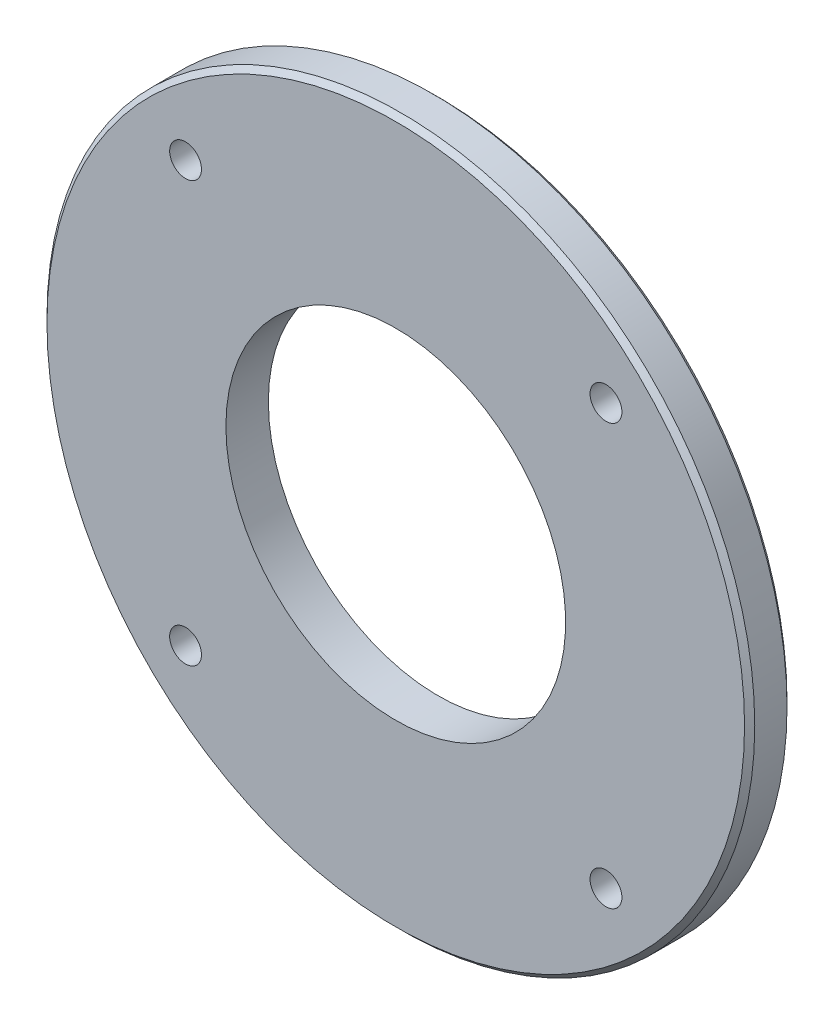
ISO-10303-21;
HEADER;
FILE_DESCRIPTION(('STEP AP214'),'2;1');
FILE_NAME('part.step','',(''),(''),'','','');
FILE_SCHEMA(('AUTOMOTIVE_DESIGN { 1 0 10303 214 1 1 1 1 }'));
ENDSEC;
DATA;
#1=APPLICATION_CONTEXT('core data for automotive mechanical design processes');
#2=APPLICATION_PROTOCOL_DEFINITION('international standard','automotive_design',2000,#1);
#3=PRODUCT_CONTEXT('',#1,'mechanical');
#4=PRODUCT('Part','Part','',(#3));
#5=PRODUCT_RELATED_PRODUCT_CATEGORY('part','',(#4));
#6=PRODUCT_DEFINITION_FORMATION('','',#4);
#7=PRODUCT_DEFINITION_CONTEXT('part definition',#1,'design');
#8=PRODUCT_DEFINITION('design','',#6,#7);
#9=PRODUCT_DEFINITION_SHAPE('','',#8);
#10=(LENGTH_UNIT() NAMED_UNIT(*) SI_UNIT(.MILLI.,.METRE.));
#11=(NAMED_UNIT(*) PLANE_ANGLE_UNIT() SI_UNIT($,.RADIAN.));
#12=(NAMED_UNIT(*) SI_UNIT($,.STERADIAN.) SOLID_ANGLE_UNIT());
#13=UNCERTAINTY_MEASURE_WITH_UNIT(LENGTH_MEASURE(1.E-05),#10,'distance_accuracy_value','');
#14=(GEOMETRIC_REPRESENTATION_CONTEXT(3) GLOBAL_UNCERTAINTY_ASSIGNED_CONTEXT((#13)) GLOBAL_UNIT_ASSIGNED_CONTEXT((#10,
#11,#12)) REPRESENTATION_CONTEXT('',''));
#15=CARTESIAN_POINT('',(0.,0.,0.));
#16=DIRECTION('',(0.,0.,1.));
#17=DIRECTION('',(1.,0.,0.));
#18=AXIS2_PLACEMENT_3D('',#15,#16,#17);
#19=CARTESIAN_POINT('',(0.,0.,9.52500000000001));
#20=DIRECTION('',(0.,0.,1.));
#21=DIRECTION('',(1.,0.,0.));
#22=AXIS2_PLACEMENT_3D('',#19,#20,#21);
#23=PLANE('',#22);
#24=CARTESIAN_POINT('',(0.,0.,9.52500000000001));
#25=DIRECTION('',(0.,0.,1.));
#26=DIRECTION('',(1.,0.,0.));
#27=AXIS2_PLACEMENT_3D('',#24,#25,#26);
#28=CIRCLE('',#27,78.232);
#29=CARTESIAN_POINT('',(78.2320000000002,0.,9.52500000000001));
#30=VERTEX_POINT('',#29);
#31=EDGE_CURVE('E10',#30,#30,#28,.T.);
#32=ORIENTED_EDGE('',*,*,#31,.T.);
#33=EDGE_LOOP('',(#32));
#34=FACE_BOUND('',#33,.T.);
#35=CARTESIAN_POINT('',(-47.1463446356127,47.1463446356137,9.52500000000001));
#36=DIRECTION('',(0.,0.,1.));
#37=DIRECTION('',(0.,1.,0.));
#38=AXIS2_PLACEMENT_3D('',#35,#36,#37);
#39=CIRCLE('',#38,3.5687);
#40=CARTESIAN_POINT('',(-43.5776446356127,47.1463446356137,9.525));
#41=VERTEX_POINT('',#40);
#42=EDGE_CURVE('E426',#41,#41,#39,.T.);
#43=ORIENTED_EDGE('',*,*,#42,.F.);
#44=EDGE_LOOP('',(#43));
#45=FACE_BOUND('',#44,.T.);
#46=CARTESIAN_POINT('',(-47.1463446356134,-47.1463446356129,9.52500000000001));
#47=DIRECTION('',(0.,0.,1.));
#48=DIRECTION('',(-1.,0.,0.));
#49=AXIS2_PLACEMENT_3D('',#46,#47,#48);
#50=CIRCLE('',#49,3.5687);
#51=CARTESIAN_POINT('',(-43.5776446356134,-47.1463446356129,9.525));
#52=VERTEX_POINT('',#51);
#53=EDGE_CURVE('E420',#52,#52,#50,.T.);
#54=ORIENTED_EDGE('',*,*,#53,.F.);
#55=EDGE_LOOP('',(#54));
#56=FACE_BOUND('',#55,.T.);
#57=CARTESIAN_POINT('',(47.1463446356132,-47.1463446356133,9.52500000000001));
#58=DIRECTION('',(0.,0.,1.));
#59=DIRECTION('',(0.,-1.,0.));
#60=AXIS2_PLACEMENT_3D('',#57,#58,#59);
#61=CIRCLE('',#60,3.5687);
#62=CARTESIAN_POINT('',(50.7150446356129,-47.1463446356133,9.525));
#63=VERTEX_POINT('',#62);
#64=EDGE_CURVE('E414',#63,#63,#61,.T.);
#65=ORIENTED_EDGE('',*,*,#64,.F.);
#66=EDGE_LOOP('',(#65));
#67=FACE_BOUND('',#66,.T.);
#68=CARTESIAN_POINT('',(47.1463446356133,47.1463446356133,9.52500000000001));
#69=DIRECTION('',(0.,0.,1.));
#70=DIRECTION('',(1.,0.,0.));
#71=AXIS2_PLACEMENT_3D('',#68,#69,#70);
#72=CIRCLE('',#71,3.5687);
#73=CARTESIAN_POINT('',(50.7150446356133,47.1463446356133,9.525));
#74=VERTEX_POINT('',#73);
#75=EDGE_CURVE('E408',#74,#74,#72,.T.);
#76=ORIENTED_EDGE('',*,*,#75,.F.);
#77=EDGE_LOOP('',(#76));
#78=FACE_BOUND('',#77,.T.);
#79=CARTESIAN_POINT('',(0.,0.,9.52500000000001));
#80=DIRECTION('',(0.,0.,1.));
#81=DIRECTION('',(1.,0.,0.));
#82=AXIS2_PLACEMENT_3D('',#79,#80,#81);
#83=CIRCLE('',#82,38.1);
#84=CARTESIAN_POINT('',(-38.1000000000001,0.,9.52500000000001));
#85=VERTEX_POINT('',#84);
#86=EDGE_CURVE('E399',#85,#85,#83,.T.);
#87=ORIENTED_EDGE('',*,*,#86,.F.);
#88=EDGE_LOOP('',(#87));
#89=FACE_BOUND('',#88,.T.);
#90=ADVANCED_FACE('F379',(#34,#45,#56,#67,#78,#89),#23,.T.);
#91=CARTESIAN_POINT('',(0.,0.,0.));
#92=DIRECTION('',(0.,0.,1.));
#93=DIRECTION('',(1.,0.,0.));
#94=AXIS2_PLACEMENT_3D('',#91,#92,#93);
#95=PLANE('',#94);
#96=CARTESIAN_POINT('',(0.,0.,0.));
#97=DIRECTION('',(0.,0.,1.));
#98=DIRECTION('',(1.,0.,0.));
#99=AXIS2_PLACEMENT_3D('',#96,#97,#98);
#100=CIRCLE('',#99,78.232);
#101=CARTESIAN_POINT('',(78.2320000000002,0.,0.));
#102=VERTEX_POINT('',#101);
#103=EDGE_CURVE('E386',#102,#102,#100,.F.);
#104=ORIENTED_EDGE('',*,*,#103,.T.);
#105=EDGE_LOOP('',(#104));
#106=FACE_BOUND('',#105,.T.);
#107=CARTESIAN_POINT('',(-47.1463446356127,47.1463446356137,0.));
#108=DIRECTION('',(0.,0.,1.));
#109=DIRECTION('',(0.,1.,0.));
#110=AXIS2_PLACEMENT_3D('',#107,#108,#109);
#111=CIRCLE('',#110,3.5687);
#112=CARTESIAN_POINT('',(-43.5776446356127,47.1463446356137,0.));
#113=VERTEX_POINT('',#112);
#114=EDGE_CURVE('E423',#113,#113,#111,.T.);
#115=ORIENTED_EDGE('',*,*,#114,.T.);
#116=EDGE_LOOP('',(#115));
#117=FACE_BOUND('',#116,.T.);
#118=CARTESIAN_POINT('',(-47.1463446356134,-47.1463446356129,0.));
#119=DIRECTION('',(0.,0.,1.));
#120=DIRECTION('',(-1.,0.,0.));
#121=AXIS2_PLACEMENT_3D('',#118,#119,#120);
#122=CIRCLE('',#121,3.5687);
#123=CARTESIAN_POINT('',(-43.5776446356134,-47.1463446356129,0.));
#124=VERTEX_POINT('',#123);
#125=EDGE_CURVE('E417',#124,#124,#122,.T.);
#126=ORIENTED_EDGE('',*,*,#125,.T.);
#127=EDGE_LOOP('',(#126));
#128=FACE_BOUND('',#127,.T.);
#129=CARTESIAN_POINT('',(47.1463446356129,-47.1463446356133,0.));
#130=DIRECTION('',(0.,0.,1.));
#131=DIRECTION('',(0.,-1.,0.));
#132=AXIS2_PLACEMENT_3D('',#129,#130,#131);
#133=CIRCLE('',#132,3.5687);
#134=CARTESIAN_POINT('',(50.7150446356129,-47.1463446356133,0.));
#135=VERTEX_POINT('',#134);
#136=EDGE_CURVE('E411',#135,#135,#133,.T.);
#137=ORIENTED_EDGE('',*,*,#136,.T.);
#138=EDGE_LOOP('',(#137));
#139=FACE_BOUND('',#138,.T.);
#140=CARTESIAN_POINT('',(47.1463446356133,47.1463446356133,0.));
#141=DIRECTION('',(0.,0.,1.));
#142=DIRECTION('',(1.,0.,0.));
#143=AXIS2_PLACEMENT_3D('',#140,#141,#142);
#144=CIRCLE('',#143,3.5687);
#145=CARTESIAN_POINT('',(50.7150446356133,47.1463446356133,0.));
#146=VERTEX_POINT('',#145);
#147=EDGE_CURVE('E405',#146,#146,#144,.T.);
#148=ORIENTED_EDGE('',*,*,#147,.T.);
#149=EDGE_LOOP('',(#148));
#150=FACE_BOUND('',#149,.T.);
#151=CARTESIAN_POINT('',(0.,0.,0.));
#152=DIRECTION('',(0.,0.,1.));
#153=DIRECTION('',(1.,0.,0.));
#154=AXIS2_PLACEMENT_3D('',#151,#152,#153);
#155=CIRCLE('',#154,38.1);
#156=CARTESIAN_POINT('',(-38.1000000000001,0.,0.));
#157=VERTEX_POINT('',#156);
#158=EDGE_CURVE('E402',#157,#157,#155,.T.);
#159=ORIENTED_EDGE('',*,*,#158,.T.);
#160=EDGE_LOOP('',(#159));
#161=FACE_BOUND('',#160,.T.);
#162=ADVANCED_FACE('F434',(#106,#117,#128,#139,#150,#161),#95,.F.);
#163=CARTESIAN_POINT('',(0.,0.,9.52500000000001));
#164=DIRECTION('',(0.,0.,-1.));
#165=DIRECTION('',(-1.,0.,0.));
#166=AXIS2_PLACEMENT_3D('',#163,#164,#165);
#167=CYLINDRICAL_SURFACE('',#166,79.375);
#168=CARTESIAN_POINT('',(0.,0.,1.14299999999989));
#169=DIRECTION('',(0.,0.,1.));
#170=DIRECTION('',(1.,0.,0.));
#171=AXIS2_PLACEMENT_3D('',#168,#169,#170);
#172=CIRCLE('',#171,79.375);
#173=CARTESIAN_POINT('',(-79.3750000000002,0.,1.1429999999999));
#174=VERTEX_POINT('',#173);
#175=EDGE_CURVE('E390',#174,#174,#172,.T.);
#176=CARTESIAN_POINT('',(0.,0.,8.38200000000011));
#177=DIRECTION('',(0.,0.,1.));
#178=DIRECTION('',(1.,0.,0.));
#179=AXIS2_PLACEMENT_3D('',#176,#177,#178);
#180=CIRCLE('',#179,79.375);
#181=CARTESIAN_POINT('',(-79.3750000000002,0.,8.38200000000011));
#182=VERTEX_POINT('',#181);
#183=EDGE_CURVE('E394',#182,#182,#180,.F.);
#184=CARTESIAN_POINT('',(-79.3750000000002,0.,1.1429999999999));
#185=CARTESIAN_POINT('',(-79.3750000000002,0.,1.2184062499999));
#186=CARTESIAN_POINT('',(-79.3750000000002,0.,1.2938124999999));
#187=CARTESIAN_POINT('',(-79.3750000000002,0.,1.44462499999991));
#188=CARTESIAN_POINT('',(-79.3750000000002,0.,1.52003124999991));
#189=CARTESIAN_POINT('',(-79.3750000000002,0.,1.67084374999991));
#190=CARTESIAN_POINT('',(-79.3750000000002,0.,1.74624999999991));
#191=CARTESIAN_POINT('',(-79.3750000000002,0.,1.89706249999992));
#192=CARTESIAN_POINT('',(-79.3750000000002,0.,1.97246874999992));
#193=CARTESIAN_POINT('',(-79.3750000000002,0.,2.12328124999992));
#194=CARTESIAN_POINT('',(-79.3750000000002,0.,2.19868749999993));
#195=CARTESIAN_POINT('',(-79.3750000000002,0.,2.34949999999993));
#196=CARTESIAN_POINT('',(-79.3750000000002,0.,2.42490624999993));
#197=CARTESIAN_POINT('',(-79.3750000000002,0.,2.57571874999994));
#198=CARTESIAN_POINT('',(-79.3750000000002,0.,2.65112499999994));
#199=CARTESIAN_POINT('',(-79.3750000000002,0.,2.80193749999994));
#200=CARTESIAN_POINT('',(-79.3750000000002,0.,2.87734374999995));
#201=CARTESIAN_POINT('',(-79.3750000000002,0.,3.02815624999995));
#202=CARTESIAN_POINT('',(-79.3750000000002,0.,3.10356249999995));
#203=CARTESIAN_POINT('',(-79.3750000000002,0.,3.25437499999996));
#204=CARTESIAN_POINT('',(-79.3750000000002,0.,3.32978124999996));
#205=CARTESIAN_POINT('',(-79.3750000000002,0.,3.48059374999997));
#206=CARTESIAN_POINT('',(-79.3750000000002,0.,3.55599999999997));
#207=CARTESIAN_POINT('',(-79.3750000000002,0.,3.70681249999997));
#208=CARTESIAN_POINT('',(-79.3750000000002,0.,3.78221874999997));
#209=CARTESIAN_POINT('',(-79.3750000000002,0.,3.93303124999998));
#210=CARTESIAN_POINT('',(-79.3750000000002,0.,4.00843749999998));
#211=CARTESIAN_POINT('',(-79.3750000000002,0.,4.15924999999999));
#212=CARTESIAN_POINT('',(-79.3750000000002,0.,4.23465624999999));
#213=CARTESIAN_POINT('',(-79.3750000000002,0.,4.38546874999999));
#214=CARTESIAN_POINT('',(-79.3750000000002,0.,4.46087499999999));
#215=CARTESIAN_POINT('',(-79.3750000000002,0.,4.6116875));
#216=CARTESIAN_POINT('',(-79.3750000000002,0.,4.68709375));
#217=CARTESIAN_POINT('',(-79.3750000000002,0.,4.83790625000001));
#218=CARTESIAN_POINT('',(-79.3750000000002,0.,4.91331250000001));
#219=CARTESIAN_POINT('',(-79.3750000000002,0.,5.06412500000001));
#220=CARTESIAN_POINT('',(-79.3750000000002,0.,5.13953125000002));
#221=CARTESIAN_POINT('',(-79.3750000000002,0.,5.29034375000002));
#222=CARTESIAN_POINT('',(-79.3750000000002,0.,5.36575000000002));
#223=CARTESIAN_POINT('',(-79.3750000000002,0.,5.51656250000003));
#224=CARTESIAN_POINT('',(-79.3750000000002,0.,5.59196875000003));
#225=CARTESIAN_POINT('',(-79.3750000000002,0.,5.74278125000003));
#226=CARTESIAN_POINT('',(-79.3750000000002,0.,5.81818750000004));
#227=CARTESIAN_POINT('',(-79.3750000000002,0.,5.96900000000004));
#228=CARTESIAN_POINT('',(-79.3750000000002,0.,6.04440625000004));
#229=CARTESIAN_POINT('',(-79.3750000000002,0.,6.19521875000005));
#230=CARTESIAN_POINT('',(-79.3750000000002,0.,6.27062500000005));
#231=CARTESIAN_POINT('',(-79.3750000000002,0.,6.42143750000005));
#232=CARTESIAN_POINT('',(-79.3750000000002,0.,6.49684375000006));
#233=CARTESIAN_POINT('',(-79.3750000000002,0.,6.64765625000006));
#234=CARTESIAN_POINT('',(-79.3750000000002,0.,6.72306250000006));
#235=CARTESIAN_POINT('',(-79.3750000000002,0.,6.87387500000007));
#236=CARTESIAN_POINT('',(-79.3750000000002,0.,6.94928125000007));
#237=CARTESIAN_POINT('',(-79.3750000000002,0.,7.10009375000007));
#238=CARTESIAN_POINT('',(-79.3750000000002,0.,7.17550000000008));
#239=CARTESIAN_POINT('',(-79.3750000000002,0.,7.32631250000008));
#240=CARTESIAN_POINT('',(-79.3750000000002,0.,7.40171875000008));
#241=CARTESIAN_POINT('',(-79.3750000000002,0.,7.55253125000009));
#242=CARTESIAN_POINT('',(-79.3750000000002,0.,7.62793750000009));
#243=CARTESIAN_POINT('',(-79.3750000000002,0.,7.77875000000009));
#244=CARTESIAN_POINT('',(-79.3750000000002,0.,7.8541562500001));
#245=CARTESIAN_POINT('',(-79.3750000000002,0.,8.0049687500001));
#246=CARTESIAN_POINT('',(-79.3750000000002,0.,8.0803750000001));
#247=CARTESIAN_POINT('',(-79.3750000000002,0.,8.23118750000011));
#248=CARTESIAN_POINT('',(-79.3750000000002,0.,8.30659375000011));
#249=CARTESIAN_POINT('',(-79.3750000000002,0.,8.38200000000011));
#250=B_SPLINE_CURVE_WITH_KNOTS('',3,(#184,#185,#186,#187,#188,#189,#190,#191,#192,#193,#194,
#195,#196,#197,#198,#199,#200,#201,#202,#203,#204,#205,#206,#207,#208,#209,#210,#211,#212,#213,
#214,#215,#216,#217,#218,#219,#220,#221,#222,#223,#224,#225,#226,#227,#228,#229,#230,#231,#232,
#233,#234,#235,#236,#237,#238,#239,#240,#241,#242,#243,#244,#245,#246,#247,#248,#249),
.UNSPECIFIED.,.F.,.F.,(4,2,2,2,2,2,2,2,2,2,2,2,2,2,2,2,2,2,2,2,2,2,2,2,2,2,2,2,2,2,2,2,4),(0.,
0.226218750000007,0.452437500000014,0.67865625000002,0.904875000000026,1.13109375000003,
1.35731250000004,1.58353125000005,1.80975000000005,2.03596875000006,2.26218750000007,
2.48840625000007,2.71462500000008,2.94084375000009,3.16706250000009,3.3932812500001,
3.61950000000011,3.84571875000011,4.07193750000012,4.29815625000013,4.52437500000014,
4.75059375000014,4.97681250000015,5.20303125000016,5.42925000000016,5.65546875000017,
5.88168750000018,6.10790625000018,6.33412500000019,6.5603437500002,6.7865625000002,
7.01278125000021,7.23900000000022),.UNSPECIFIED.);
#251=EDGE_CURVE('BSEAM381',#174,#182,#250,.T.);
#252=ORIENTED_EDGE('',*,*,#175,.T.);
#253=ORIENTED_EDGE('',*,*,#183,.T.);
#254=ORIENTED_EDGE('',*,*,#251,.T.);
#255=ORIENTED_EDGE('',*,*,#251,.F.);
#256=EDGE_LOOP('',(#252,#254,#253,#255));
#257=FACE_BOUND('',#256,.T.);
#258=ADVANCED_FACE('F381',(#257),#167,.T.);
#259=CARTESIAN_POINT('',(0.,0.,9.52500000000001));
#260=DIRECTION('',(0.,0.,-1.));
#261=DIRECTION('',(-1.,0.,0.));
#262=AXIS2_PLACEMENT_3D('',#259,#260,#261);
#263=CYLINDRICAL_SURFACE('',#262,38.1);
#264=CARTESIAN_POINT('',(-38.1000000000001,0.,9.52500000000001));
#265=CARTESIAN_POINT('',(-38.1000000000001,0.,9.42578125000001));
#266=CARTESIAN_POINT('',(-38.1000000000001,0.,9.32656250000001));
#267=CARTESIAN_POINT('',(-38.1000000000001,0.,9.12812500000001));
#268=CARTESIAN_POINT('',(-38.1000000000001,0.,9.02890625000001));
#269=CARTESIAN_POINT('',(-38.1000000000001,0.,8.83046875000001));
#270=CARTESIAN_POINT('',(-38.1000000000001,0.,8.73125000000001));
#271=CARTESIAN_POINT('',(-38.1000000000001,0.,8.53281250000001));
#272=CARTESIAN_POINT('',(-38.1000000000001,0.,8.43359375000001));
#273=CARTESIAN_POINT('',(-38.1000000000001,0.,8.23515625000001));
#274=CARTESIAN_POINT('',(-38.1000000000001,0.,8.13593750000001));
#275=CARTESIAN_POINT('',(-38.1000000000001,0.,7.93750000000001));
#276=CARTESIAN_POINT('',(-38.1000000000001,0.,7.83828125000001));
#277=CARTESIAN_POINT('',(-38.1000000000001,0.,7.63984375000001));
#278=CARTESIAN_POINT('',(-38.1000000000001,0.,7.54062500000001));
#279=CARTESIAN_POINT('',(-38.1000000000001,0.,7.34218750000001));
#280=CARTESIAN_POINT('',(-38.1000000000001,0.,7.24296875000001));
#281=CARTESIAN_POINT('',(-38.1000000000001,0.,7.04453125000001));
#282=CARTESIAN_POINT('',(-38.1000000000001,0.,6.94531250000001));
#283=CARTESIAN_POINT('',(-38.1000000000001,0.,6.74687500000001));
#284=CARTESIAN_POINT('',(-38.1000000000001,0.,6.64765625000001));
#285=CARTESIAN_POINT('',(-38.1000000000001,0.,6.44921875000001));
#286=CARTESIAN_POINT('',(-38.1000000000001,0.,6.35000000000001));
#287=CARTESIAN_POINT('',(-38.1000000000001,0.,6.15156250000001));
#288=CARTESIAN_POINT('',(-38.1000000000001,0.,6.05234375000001));
#289=CARTESIAN_POINT('',(-38.1000000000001,0.,5.85390625));
#290=CARTESIAN_POINT('',(-38.1000000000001,0.,5.75468750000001));
#291=CARTESIAN_POINT('',(-38.1000000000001,0.,5.55625));
#292=CARTESIAN_POINT('',(-38.1000000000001,0.,5.45703125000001));
#293=CARTESIAN_POINT('',(-38.1000000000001,0.,5.25859375));
#294=CARTESIAN_POINT('',(-38.1000000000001,0.,5.15937500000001));
#295=CARTESIAN_POINT('',(-38.1000000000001,0.,4.9609375));
#296=CARTESIAN_POINT('',(-38.1000000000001,0.,4.86171875));
#297=CARTESIAN_POINT('',(-38.1000000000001,0.,4.66328125));
#298=CARTESIAN_POINT('',(-38.1000000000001,0.,4.5640625));
#299=CARTESIAN_POINT('',(-38.1000000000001,0.,4.365625));
#300=CARTESIAN_POINT('',(-38.1000000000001,0.,4.26640625));
#301=CARTESIAN_POINT('',(-38.1000000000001,0.,4.06796875));
#302=CARTESIAN_POINT('',(-38.1000000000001,0.,3.96875));
#303=CARTESIAN_POINT('',(-38.1000000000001,0.,3.7703125));
#304=CARTESIAN_POINT('',(-38.1000000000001,0.,3.67109375));
#305=CARTESIAN_POINT('',(-38.1000000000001,0.,3.47265625));
#306=CARTESIAN_POINT('',(-38.1000000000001,0.,3.3734375));
#307=CARTESIAN_POINT('',(-38.1000000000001,0.,3.175));
#308=CARTESIAN_POINT('',(-38.1000000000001,0.,3.07578125));
#309=CARTESIAN_POINT('',(-38.1000000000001,0.,2.87734375));
#310=CARTESIAN_POINT('',(-38.1000000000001,0.,2.778125));
#311=CARTESIAN_POINT('',(-38.1000000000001,0.,2.5796875));
#312=CARTESIAN_POINT('',(-38.1000000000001,0.,2.48046875));
#313=CARTESIAN_POINT('',(-38.1000000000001,0.,2.28203125));
#314=CARTESIAN_POINT('',(-38.1000000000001,0.,2.1828125));
#315=CARTESIAN_POINT('',(-38.1000000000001,0.,1.984375));
#316=CARTESIAN_POINT('',(-38.1000000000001,0.,1.88515625));
#317=CARTESIAN_POINT('',(-38.1000000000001,0.,1.68671875));
#318=CARTESIAN_POINT('',(-38.1000000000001,0.,1.5875));
#319=CARTESIAN_POINT('',(-38.1000000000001,0.,1.3890625));
#320=CARTESIAN_POINT('',(-38.1000000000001,0.,1.28984375));
#321=CARTESIAN_POINT('',(-38.1000000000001,0.,1.09140625));
#322=CARTESIAN_POINT('',(-38.1000000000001,0.,0.992187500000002));
#323=CARTESIAN_POINT('',(-38.1000000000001,0.,0.793750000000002));
#324=CARTESIAN_POINT('',(-38.1000000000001,0.,0.694531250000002));
#325=CARTESIAN_POINT('',(-38.1000000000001,0.,0.496093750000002));
#326=CARTESIAN_POINT('',(-38.1000000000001,0.,0.396875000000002));
#327=CARTESIAN_POINT('',(-38.1000000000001,0.,0.198437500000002));
#328=CARTESIAN_POINT('',(-38.1000000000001,0.,0.0992187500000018));
#329=CARTESIAN_POINT('',(-38.1000000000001,0.,0.));
#330=B_SPLINE_CURVE_WITH_KNOTS('',3,(#264,#265,#266,#267,#268,#269,#270,#271,#272,#273,#274,
#275,#276,#277,#278,#279,#280,#281,#282,#283,#284,#285,#286,#287,#288,#289,#290,#291,#292,#293,
#294,#295,#296,#297,#298,#299,#300,#301,#302,#303,#304,#305,#306,#307,#308,#309,#310,#311,#312,
#313,#314,#315,#316,#317,#318,#319,#320,#321,#322,#323,#324,#325,#326,#327,#328,#329),
.UNSPECIFIED.,.F.,.F.,(4,2,2,2,2,2,2,2,2,2,2,2,2,2,2,2,2,2,2,2,2,2,2,2,2,2,2,2,2,2,2,2,4),(0.,
0.297656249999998,0.595312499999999,0.892968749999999,1.190625,1.48828125,1.7859375,2.08359375,
2.38125,2.67890625,2.9765625,3.27421875,3.571875,3.86953125,4.1671875,4.46484375,4.7625,
5.06015625,5.3578125,5.65546875,5.953125,6.25078125,6.5484375,6.84609375,7.14375,7.44140625,
7.7390625,8.03671875,8.334375,8.63203125,8.9296875,9.22734375,9.525),.UNSPECIFIED.);
#331=EDGE_CURVE('BSEAM443',#85,#157,#330,.T.);
#332=ORIENTED_EDGE('',*,*,#86,.T.);
#333=ORIENTED_EDGE('',*,*,#158,.F.);
#334=ORIENTED_EDGE('',*,*,#331,.T.);
#335=ORIENTED_EDGE('',*,*,#331,.F.);
#336=EDGE_LOOP('',(#332,#334,#333,#335));
#337=FACE_BOUND('',#336,.T.);
#338=ADVANCED_FACE('F443',(#337),#263,.F.);
#339=CARTESIAN_POINT('',(47.1463446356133,47.1463446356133,0.));
#340=DIRECTION('',(0.,0.,1.));
#341=DIRECTION('',(1.,0.,0.));
#342=AXIS2_PLACEMENT_3D('',#339,#340,#341);
#343=CYLINDRICAL_SURFACE('',#342,3.5687);
#344=CARTESIAN_POINT('',(50.7150446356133,47.1463446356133,0.));
#345=CARTESIAN_POINT('',(50.7150446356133,47.1463446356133,0.0992187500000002));
#346=CARTESIAN_POINT('',(50.7150446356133,47.1463446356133,0.1984375));
#347=CARTESIAN_POINT('',(50.7150446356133,47.1463446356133,0.396875));
#348=CARTESIAN_POINT('',(50.7150446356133,47.1463446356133,0.49609375));
#349=CARTESIAN_POINT('',(50.7150446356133,47.1463446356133,0.69453125));
#350=CARTESIAN_POINT('',(50.7150446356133,47.1463446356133,0.79375));
#351=CARTESIAN_POINT('',(50.7150446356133,47.1463446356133,0.9921875));
#352=CARTESIAN_POINT('',(50.7150446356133,47.1463446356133,1.09140625));
#353=CARTESIAN_POINT('',(50.7150446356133,47.1463446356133,1.28984375));
#354=CARTESIAN_POINT('',(50.7150446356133,47.1463446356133,1.3890625));
#355=CARTESIAN_POINT('',(50.7150446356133,47.1463446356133,1.5875));
#356=CARTESIAN_POINT('',(50.7150446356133,47.1463446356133,1.68671875));
#357=CARTESIAN_POINT('',(50.7150446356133,47.1463446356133,1.88515625));
#358=CARTESIAN_POINT('',(50.7150446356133,47.1463446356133,1.984375));
#359=CARTESIAN_POINT('',(50.7150446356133,47.1463446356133,2.1828125));
#360=CARTESIAN_POINT('',(50.7150446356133,47.1463446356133,2.28203125));
#361=CARTESIAN_POINT('',(50.7150446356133,47.1463446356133,2.48046875));
#362=CARTESIAN_POINT('',(50.7150446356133,47.1463446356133,2.5796875));
#363=CARTESIAN_POINT('',(50.7150446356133,47.1463446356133,2.778125));
#364=CARTESIAN_POINT('',(50.7150446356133,47.1463446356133,2.87734375));
#365=CARTESIAN_POINT('',(50.7150446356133,47.1463446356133,3.07578125));
#366=CARTESIAN_POINT('',(50.7150446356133,47.1463446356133,3.175));
#367=CARTESIAN_POINT('',(50.7150446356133,47.1463446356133,3.3734375));
#368=CARTESIAN_POINT('',(50.7150446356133,47.1463446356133,3.47265625));
#369=CARTESIAN_POINT('',(50.7150446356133,47.1463446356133,3.67109375));
#370=CARTESIAN_POINT('',(50.7150446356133,47.1463446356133,3.7703125));
#371=CARTESIAN_POINT('',(50.7150446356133,47.1463446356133,3.96875));
#372=CARTESIAN_POINT('',(50.7150446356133,47.1463446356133,4.06796875));
#373=CARTESIAN_POINT('',(50.7150446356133,47.1463446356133,4.26640625));
#374=CARTESIAN_POINT('',(50.7150446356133,47.1463446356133,4.365625));
#375=CARTESIAN_POINT('',(50.7150446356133,47.1463446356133,4.5640625));
#376=CARTESIAN_POINT('',(50.7150446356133,47.1463446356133,4.66328125));
#377=CARTESIAN_POINT('',(50.7150446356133,47.1463446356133,4.86171875));
#378=CARTESIAN_POINT('',(50.7150446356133,47.1463446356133,4.9609375));
#379=CARTESIAN_POINT('',(50.7150446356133,47.1463446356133,5.159375));
#380=CARTESIAN_POINT('',(50.7150446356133,47.1463446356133,5.25859375));
#381=CARTESIAN_POINT('',(50.7150446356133,47.1463446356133,5.45703125));
#382=CARTESIAN_POINT('',(50.7150446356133,47.1463446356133,5.55625));
#383=CARTESIAN_POINT('',(50.7150446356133,47.1463446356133,5.7546875));
#384=CARTESIAN_POINT('',(50.7150446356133,47.1463446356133,5.85390625));
#385=CARTESIAN_POINT('',(50.7150446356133,47.1463446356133,6.05234375));
#386=CARTESIAN_POINT('',(50.7150446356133,47.1463446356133,6.1515625));
#387=CARTESIAN_POINT('',(50.7150446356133,47.1463446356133,6.35));
#388=CARTESIAN_POINT('',(50.7150446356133,47.1463446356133,6.44921875));
#389=CARTESIAN_POINT('',(50.7150446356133,47.1463446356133,6.64765625));
#390=CARTESIAN_POINT('',(50.7150446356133,47.1463446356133,6.746875));
#391=CARTESIAN_POINT('',(50.7150446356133,47.1463446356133,6.9453125));
#392=CARTESIAN_POINT('',(50.7150446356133,47.1463446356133,7.04453125));
#393=CARTESIAN_POINT('',(50.7150446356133,47.1463446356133,7.24296875));
#394=CARTESIAN_POINT('',(50.7150446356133,47.1463446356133,7.3421875));
#395=CARTESIAN_POINT('',(50.7150446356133,47.1463446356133,7.540625));
#396=CARTESIAN_POINT('',(50.7150446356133,47.1463446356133,7.63984375));
#397=CARTESIAN_POINT('',(50.7150446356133,47.1463446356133,7.83828125));
#398=CARTESIAN_POINT('',(50.7150446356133,47.1463446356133,7.9375));
#399=CARTESIAN_POINT('',(50.7150446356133,47.1463446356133,8.1359375));
#400=CARTESIAN_POINT('',(50.7150446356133,47.1463446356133,8.23515625));
#401=CARTESIAN_POINT('',(50.7150446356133,47.1463446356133,8.43359375));
#402=CARTESIAN_POINT('',(50.7150446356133,47.1463446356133,8.5328125));
#403=CARTESIAN_POINT('',(50.7150446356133,47.1463446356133,8.73125));
#404=CARTESIAN_POINT('',(50.7150446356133,47.1463446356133,8.83046875));
#405=CARTESIAN_POINT('',(50.7150446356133,47.1463446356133,9.02890625));
#406=CARTESIAN_POINT('',(50.7150446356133,47.1463446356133,9.128125));
#407=CARTESIAN_POINT('',(50.7150446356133,47.1463446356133,9.3265625));
#408=CARTESIAN_POINT('',(50.7150446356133,47.1463446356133,9.42578125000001));
#409=CARTESIAN_POINT('',(50.7150446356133,47.1463446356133,9.525));
#410=B_SPLINE_CURVE_WITH_KNOTS('',3,(#344,#345,#346,#347,#348,#349,#350,#351,#352,#353,#354,
#355,#356,#357,#358,#359,#360,#361,#362,#363,#364,#365,#366,#367,#368,#369,#370,#371,#372,#373,
#374,#375,#376,#377,#378,#379,#380,#381,#382,#383,#384,#385,#386,#387,#388,#389,#390,#391,#392,
#393,#394,#395,#396,#397,#398,#399,#400,#401,#402,#403,#404,#405,#406,#407,#408,#409),
.UNSPECIFIED.,.F.,.F.,(4,2,2,2,2,2,2,2,2,2,2,2,2,2,2,2,2,2,2,2,2,2,2,2,2,2,2,2,2,2,2,2,4),(0.,
0.29765625,0.5953125,0.89296875,1.190625,1.48828125,1.7859375,2.08359375,2.38125,2.67890625,
2.9765625,3.27421875,3.571875,3.86953125,4.1671875,4.46484375,4.7625,5.06015625,5.3578125,
5.65546875,5.953125,6.25078125,6.5484375,6.84609375,7.14375,7.44140625,7.7390625,8.03671875,
8.334375,8.63203125,8.9296875,9.22734375,9.525),.UNSPECIFIED.);
#411=EDGE_CURVE('BSEAM446',#146,#74,#410,.T.);
#412=ORIENTED_EDGE('',*,*,#147,.F.);
#413=ORIENTED_EDGE('',*,*,#75,.T.);
#414=ORIENTED_EDGE('',*,*,#411,.T.);
#415=ORIENTED_EDGE('',*,*,#411,.F.);
#416=EDGE_LOOP('',(#412,#414,#413,#415));
#417=FACE_BOUND('',#416,.T.);
#418=ADVANCED_FACE('F446',(#417),#343,.F.);
#419=CARTESIAN_POINT('',(47.1463446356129,-47.1463446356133,0.));
#420=DIRECTION('',(0.,0.,1.));
#421=DIRECTION('',(1.,0.,0.));
#422=AXIS2_PLACEMENT_3D('',#419,#420,#421);
#423=CYLINDRICAL_SURFACE('',#422,3.5687);
#424=CARTESIAN_POINT('',(50.7150446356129,-47.1463446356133,0.));
#425=CARTESIAN_POINT('',(50.7150446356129,-47.1463446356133,0.0992187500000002));
#426=CARTESIAN_POINT('',(50.7150446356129,-47.1463446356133,0.1984375));
#427=CARTESIAN_POINT('',(50.7150446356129,-47.1463446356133,0.396875));
#428=CARTESIAN_POINT('',(50.7150446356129,-47.1463446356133,0.49609375));
#429=CARTESIAN_POINT('',(50.7150446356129,-47.1463446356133,0.69453125));
#430=CARTESIAN_POINT('',(50.7150446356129,-47.1463446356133,0.79375));
#431=CARTESIAN_POINT('',(50.7150446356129,-47.1463446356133,0.9921875));
#432=CARTESIAN_POINT('',(50.7150446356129,-47.1463446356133,1.09140625));
#433=CARTESIAN_POINT('',(50.7150446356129,-47.1463446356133,1.28984375));
#434=CARTESIAN_POINT('',(50.7150446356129,-47.1463446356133,1.3890625));
#435=CARTESIAN_POINT('',(50.7150446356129,-47.1463446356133,1.5875));
#436=CARTESIAN_POINT('',(50.7150446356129,-47.1463446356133,1.68671875));
#437=CARTESIAN_POINT('',(50.7150446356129,-47.1463446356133,1.88515625));
#438=CARTESIAN_POINT('',(50.7150446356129,-47.1463446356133,1.984375));
#439=CARTESIAN_POINT('',(50.7150446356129,-47.1463446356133,2.1828125));
#440=CARTESIAN_POINT('',(50.7150446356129,-47.1463446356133,2.28203125));
#441=CARTESIAN_POINT('',(50.7150446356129,-47.1463446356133,2.48046875));
#442=CARTESIAN_POINT('',(50.7150446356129,-47.1463446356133,2.5796875));
#443=CARTESIAN_POINT('',(50.7150446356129,-47.1463446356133,2.778125));
#444=CARTESIAN_POINT('',(50.7150446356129,-47.1463446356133,2.87734375));
#445=CARTESIAN_POINT('',(50.7150446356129,-47.1463446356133,3.07578125));
#446=CARTESIAN_POINT('',(50.7150446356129,-47.1463446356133,3.175));
#447=CARTESIAN_POINT('',(50.7150446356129,-47.1463446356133,3.3734375));
#448=CARTESIAN_POINT('',(50.7150446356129,-47.1463446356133,3.47265625));
#449=CARTESIAN_POINT('',(50.7150446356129,-47.1463446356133,3.67109375));
#450=CARTESIAN_POINT('',(50.7150446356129,-47.1463446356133,3.7703125));
#451=CARTESIAN_POINT('',(50.7150446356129,-47.1463446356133,3.96875));
#452=CARTESIAN_POINT('',(50.7150446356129,-47.1463446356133,4.06796875));
#453=CARTESIAN_POINT('',(50.7150446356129,-47.1463446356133,4.26640625));
#454=CARTESIAN_POINT('',(50.7150446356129,-47.1463446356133,4.365625));
#455=CARTESIAN_POINT('',(50.7150446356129,-47.1463446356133,4.5640625));
#456=CARTESIAN_POINT('',(50.7150446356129,-47.1463446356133,4.66328125));
#457=CARTESIAN_POINT('',(50.7150446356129,-47.1463446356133,4.86171875));
#458=CARTESIAN_POINT('',(50.7150446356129,-47.1463446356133,4.9609375));
#459=CARTESIAN_POINT('',(50.7150446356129,-47.1463446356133,5.159375));
#460=CARTESIAN_POINT('',(50.7150446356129,-47.1463446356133,5.25859375));
#461=CARTESIAN_POINT('',(50.7150446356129,-47.1463446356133,5.45703125));
#462=CARTESIAN_POINT('',(50.7150446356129,-47.1463446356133,5.55625));
#463=CARTESIAN_POINT('',(50.7150446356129,-47.1463446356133,5.7546875));
#464=CARTESIAN_POINT('',(50.7150446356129,-47.1463446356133,5.85390625));
#465=CARTESIAN_POINT('',(50.7150446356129,-47.1463446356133,6.05234375));
#466=CARTESIAN_POINT('',(50.7150446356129,-47.1463446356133,6.1515625));
#467=CARTESIAN_POINT('',(50.7150446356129,-47.1463446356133,6.35));
#468=CARTESIAN_POINT('',(50.7150446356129,-47.1463446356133,6.44921875));
#469=CARTESIAN_POINT('',(50.7150446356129,-47.1463446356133,6.64765625));
#470=CARTESIAN_POINT('',(50.7150446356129,-47.1463446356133,6.746875));
#471=CARTESIAN_POINT('',(50.7150446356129,-47.1463446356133,6.9453125));
#472=CARTESIAN_POINT('',(50.7150446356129,-47.1463446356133,7.04453125));
#473=CARTESIAN_POINT('',(50.7150446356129,-47.1463446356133,7.24296875));
#474=CARTESIAN_POINT('',(50.7150446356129,-47.1463446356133,7.3421875));
#475=CARTESIAN_POINT('',(50.7150446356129,-47.1463446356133,7.540625));
#476=CARTESIAN_POINT('',(50.7150446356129,-47.1463446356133,7.63984375));
#477=CARTESIAN_POINT('',(50.7150446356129,-47.1463446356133,7.83828125));
#478=CARTESIAN_POINT('',(50.7150446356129,-47.1463446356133,7.9375));
#479=CARTESIAN_POINT('',(50.7150446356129,-47.1463446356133,8.1359375));
#480=CARTESIAN_POINT('',(50.7150446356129,-47.1463446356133,8.23515625));
#481=CARTESIAN_POINT('',(50.7150446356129,-47.1463446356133,8.43359375));
#482=CARTESIAN_POINT('',(50.7150446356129,-47.1463446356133,8.5328125));
#483=CARTESIAN_POINT('',(50.7150446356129,-47.1463446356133,8.73125));
#484=CARTESIAN_POINT('',(50.7150446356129,-47.1463446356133,8.83046875));
#485=CARTESIAN_POINT('',(50.7150446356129,-47.1463446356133,9.02890625));
#486=CARTESIAN_POINT('',(50.7150446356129,-47.1463446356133,9.128125));
#487=CARTESIAN_POINT('',(50.7150446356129,-47.1463446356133,9.3265625));
#488=CARTESIAN_POINT('',(50.7150446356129,-47.1463446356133,9.42578125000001));
#489=CARTESIAN_POINT('',(50.7150446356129,-47.1463446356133,9.525));
#490=B_SPLINE_CURVE_WITH_KNOTS('',3,(#424,#425,#426,#427,#428,#429,#430,#431,#432,#433,#434,
#435,#436,#437,#438,#439,#440,#441,#442,#443,#444,#445,#446,#447,#448,#449,#450,#451,#452,#453,
#454,#455,#456,#457,#458,#459,#460,#461,#462,#463,#464,#465,#466,#467,#468,#469,#470,#471,#472,
#473,#474,#475,#476,#477,#478,#479,#480,#481,#482,#483,#484,#485,#486,#487,#488,#489),
.UNSPECIFIED.,.F.,.F.,(4,2,2,2,2,2,2,2,2,2,2,2,2,2,2,2,2,2,2,2,2,2,2,2,2,2,2,2,2,2,2,2,4),(0.,
0.29765625,0.5953125,0.89296875,1.190625,1.48828125,1.7859375,2.08359375,2.38125,2.67890625,
2.9765625,3.27421875,3.571875,3.86953125,4.1671875,4.46484375,4.7625,5.06015625,5.3578125,
5.65546875,5.953125,6.25078125,6.5484375,6.84609375,7.14375,7.44140625,7.7390625,8.03671875,
8.334375,8.63203125,8.9296875,9.22734375,9.525),.UNSPECIFIED.);
#491=EDGE_CURVE('BSEAM460',#135,#63,#490,.T.);
#492=ORIENTED_EDGE('',*,*,#136,.F.);
#493=ORIENTED_EDGE('',*,*,#64,.T.);
#494=ORIENTED_EDGE('',*,*,#491,.T.);
#495=ORIENTED_EDGE('',*,*,#491,.F.);
#496=EDGE_LOOP('',(#492,#494,#493,#495));
#497=FACE_BOUND('',#496,.T.);
#498=ADVANCED_FACE('F460',(#497),#423,.F.);
#499=CARTESIAN_POINT('',(-47.1463446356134,-47.1463446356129,0.));
#500=DIRECTION('',(0.,0.,1.));
#501=DIRECTION('',(1.,0.,0.));
#502=AXIS2_PLACEMENT_3D('',#499,#500,#501);
#503=CYLINDRICAL_SURFACE('',#502,3.5687);
#504=CARTESIAN_POINT('',(-43.5776446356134,-47.1463446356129,0.));
#505=CARTESIAN_POINT('',(-43.5776446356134,-47.1463446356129,0.0992187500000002));
#506=CARTESIAN_POINT('',(-43.5776446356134,-47.1463446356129,0.1984375));
#507=CARTESIAN_POINT('',(-43.5776446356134,-47.1463446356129,0.396875));
#508=CARTESIAN_POINT('',(-43.5776446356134,-47.1463446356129,0.49609375));
#509=CARTESIAN_POINT('',(-43.5776446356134,-47.1463446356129,0.69453125));
#510=CARTESIAN_POINT('',(-43.5776446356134,-47.1463446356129,0.79375));
#511=CARTESIAN_POINT('',(-43.5776446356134,-47.1463446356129,0.9921875));
#512=CARTESIAN_POINT('',(-43.5776446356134,-47.1463446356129,1.09140625));
#513=CARTESIAN_POINT('',(-43.5776446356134,-47.1463446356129,1.28984375));
#514=CARTESIAN_POINT('',(-43.5776446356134,-47.1463446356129,1.3890625));
#515=CARTESIAN_POINT('',(-43.5776446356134,-47.1463446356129,1.5875));
#516=CARTESIAN_POINT('',(-43.5776446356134,-47.1463446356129,1.68671875));
#517=CARTESIAN_POINT('',(-43.5776446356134,-47.1463446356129,1.88515625));
#518=CARTESIAN_POINT('',(-43.5776446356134,-47.1463446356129,1.984375));
#519=CARTESIAN_POINT('',(-43.5776446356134,-47.1463446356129,2.1828125));
#520=CARTESIAN_POINT('',(-43.5776446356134,-47.1463446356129,2.28203125));
#521=CARTESIAN_POINT('',(-43.5776446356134,-47.1463446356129,2.48046875));
#522=CARTESIAN_POINT('',(-43.5776446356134,-47.1463446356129,2.5796875));
#523=CARTESIAN_POINT('',(-43.5776446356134,-47.1463446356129,2.778125));
#524=CARTESIAN_POINT('',(-43.5776446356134,-47.1463446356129,2.87734375));
#525=CARTESIAN_POINT('',(-43.5776446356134,-47.1463446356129,3.07578125));
#526=CARTESIAN_POINT('',(-43.5776446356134,-47.1463446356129,3.175));
#527=CARTESIAN_POINT('',(-43.5776446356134,-47.1463446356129,3.3734375));
#528=CARTESIAN_POINT('',(-43.5776446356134,-47.1463446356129,3.47265625));
#529=CARTESIAN_POINT('',(-43.5776446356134,-47.1463446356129,3.67109375));
#530=CARTESIAN_POINT('',(-43.5776446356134,-47.1463446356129,3.7703125));
#531=CARTESIAN_POINT('',(-43.5776446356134,-47.1463446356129,3.96875));
#532=CARTESIAN_POINT('',(-43.5776446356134,-47.1463446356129,4.06796875));
#533=CARTESIAN_POINT('',(-43.5776446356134,-47.1463446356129,4.26640625));
#534=CARTESIAN_POINT('',(-43.5776446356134,-47.1463446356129,4.365625));
#535=CARTESIAN_POINT('',(-43.5776446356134,-47.1463446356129,4.5640625));
#536=CARTESIAN_POINT('',(-43.5776446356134,-47.1463446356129,4.66328125));
#537=CARTESIAN_POINT('',(-43.5776446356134,-47.1463446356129,4.86171875));
#538=CARTESIAN_POINT('',(-43.5776446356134,-47.1463446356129,4.9609375));
#539=CARTESIAN_POINT('',(-43.5776446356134,-47.1463446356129,5.159375));
#540=CARTESIAN_POINT('',(-43.5776446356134,-47.1463446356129,5.25859375));
#541=CARTESIAN_POINT('',(-43.5776446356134,-47.1463446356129,5.45703125));
#542=CARTESIAN_POINT('',(-43.5776446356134,-47.1463446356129,5.55625));
#543=CARTESIAN_POINT('',(-43.5776446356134,-47.1463446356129,5.7546875));
#544=CARTESIAN_POINT('',(-43.5776446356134,-47.1463446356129,5.85390625));
#545=CARTESIAN_POINT('',(-43.5776446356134,-47.1463446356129,6.05234375));
#546=CARTESIAN_POINT('',(-43.5776446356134,-47.1463446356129,6.1515625));
#547=CARTESIAN_POINT('',(-43.5776446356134,-47.1463446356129,6.35));
#548=CARTESIAN_POINT('',(-43.5776446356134,-47.1463446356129,6.44921875));
#549=CARTESIAN_POINT('',(-43.5776446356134,-47.1463446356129,6.64765625));
#550=CARTESIAN_POINT('',(-43.5776446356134,-47.1463446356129,6.746875));
#551=CARTESIAN_POINT('',(-43.5776446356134,-47.1463446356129,6.9453125));
#552=CARTESIAN_POINT('',(-43.5776446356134,-47.1463446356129,7.04453125));
#553=CARTESIAN_POINT('',(-43.5776446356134,-47.1463446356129,7.24296875));
#554=CARTESIAN_POINT('',(-43.5776446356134,-47.1463446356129,7.3421875));
#555=CARTESIAN_POINT('',(-43.5776446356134,-47.1463446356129,7.540625));
#556=CARTESIAN_POINT('',(-43.5776446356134,-47.1463446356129,7.63984375));
#557=CARTESIAN_POINT('',(-43.5776446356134,-47.1463446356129,7.83828125));
#558=CARTESIAN_POINT('',(-43.5776446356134,-47.1463446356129,7.9375));
#559=CARTESIAN_POINT('',(-43.5776446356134,-47.1463446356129,8.1359375));
#560=CARTESIAN_POINT('',(-43.5776446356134,-47.1463446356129,8.23515625));
#561=CARTESIAN_POINT('',(-43.5776446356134,-47.1463446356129,8.43359375));
#562=CARTESIAN_POINT('',(-43.5776446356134,-47.1463446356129,8.5328125));
#563=CARTESIAN_POINT('',(-43.5776446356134,-47.1463446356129,8.73125));
#564=CARTESIAN_POINT('',(-43.5776446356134,-47.1463446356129,8.83046875));
#565=CARTESIAN_POINT('',(-43.5776446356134,-47.1463446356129,9.02890625));
#566=CARTESIAN_POINT('',(-43.5776446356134,-47.1463446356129,9.128125));
#567=CARTESIAN_POINT('',(-43.5776446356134,-47.1463446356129,9.3265625));
#568=CARTESIAN_POINT('',(-43.5776446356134,-47.1463446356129,9.42578125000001));
#569=CARTESIAN_POINT('',(-43.5776446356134,-47.1463446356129,9.525));
#570=B_SPLINE_CURVE_WITH_KNOTS('',3,(#504,#505,#506,#507,#508,#509,#510,#511,#512,#513,#514,
#515,#516,#517,#518,#519,#520,#521,#522,#523,#524,#525,#526,#527,#528,#529,#530,#531,#532,#533,
#534,#535,#536,#537,#538,#539,#540,#541,#542,#543,#544,#545,#546,#547,#548,#549,#550,#551,#552,
#553,#554,#555,#556,#557,#558,#559,#560,#561,#562,#563,#564,#565,#566,#567,#568,#569),
.UNSPECIFIED.,.F.,.F.,(4,2,2,2,2,2,2,2,2,2,2,2,2,2,2,2,2,2,2,2,2,2,2,2,2,2,2,2,2,2,2,2,4),(0.,
0.29765625,0.5953125,0.89296875,1.190625,1.48828125,1.7859375,2.08359375,2.38125,2.67890625,
2.9765625,3.27421875,3.571875,3.86953125,4.1671875,4.46484375,4.7625,5.06015625,5.3578125,
5.65546875,5.953125,6.25078125,6.5484375,6.84609375,7.14375,7.44140625,7.7390625,8.03671875,
8.334375,8.63203125,8.9296875,9.22734375,9.525),.UNSPECIFIED.);
#571=EDGE_CURVE('BSEAM464',#124,#52,#570,.T.);
#572=ORIENTED_EDGE('',*,*,#125,.F.);
#573=ORIENTED_EDGE('',*,*,#53,.T.);
#574=ORIENTED_EDGE('',*,*,#571,.T.);
#575=ORIENTED_EDGE('',*,*,#571,.F.);
#576=EDGE_LOOP('',(#572,#574,#573,#575));
#577=FACE_BOUND('',#576,.T.);
#578=ADVANCED_FACE('F464',(#577),#503,.F.);
#579=CARTESIAN_POINT('',(-47.1463446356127,47.1463446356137,0.));
#580=DIRECTION('',(0.,0.,1.));
#581=DIRECTION('',(1.,0.,0.));
#582=AXIS2_PLACEMENT_3D('',#579,#580,#581);
#583=CYLINDRICAL_SURFACE('',#582,3.5687);
#584=CARTESIAN_POINT('',(-43.5776446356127,47.1463446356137,0.));
#585=CARTESIAN_POINT('',(-43.5776446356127,47.1463446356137,0.0992187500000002));
#586=CARTESIAN_POINT('',(-43.5776446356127,47.1463446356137,0.1984375));
#587=CARTESIAN_POINT('',(-43.5776446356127,47.1463446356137,0.396875));
#588=CARTESIAN_POINT('',(-43.5776446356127,47.1463446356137,0.49609375));
#589=CARTESIAN_POINT('',(-43.5776446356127,47.1463446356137,0.69453125));
#590=CARTESIAN_POINT('',(-43.5776446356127,47.1463446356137,0.79375));
#591=CARTESIAN_POINT('',(-43.5776446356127,47.1463446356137,0.9921875));
#592=CARTESIAN_POINT('',(-43.5776446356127,47.1463446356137,1.09140625));
#593=CARTESIAN_POINT('',(-43.5776446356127,47.1463446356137,1.28984375));
#594=CARTESIAN_POINT('',(-43.5776446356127,47.1463446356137,1.3890625));
#595=CARTESIAN_POINT('',(-43.5776446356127,47.1463446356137,1.5875));
#596=CARTESIAN_POINT('',(-43.5776446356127,47.1463446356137,1.68671875));
#597=CARTESIAN_POINT('',(-43.5776446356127,47.1463446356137,1.88515625));
#598=CARTESIAN_POINT('',(-43.5776446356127,47.1463446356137,1.984375));
#599=CARTESIAN_POINT('',(-43.5776446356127,47.1463446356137,2.1828125));
#600=CARTESIAN_POINT('',(-43.5776446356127,47.1463446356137,2.28203125));
#601=CARTESIAN_POINT('',(-43.5776446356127,47.1463446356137,2.48046875));
#602=CARTESIAN_POINT('',(-43.5776446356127,47.1463446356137,2.5796875));
#603=CARTESIAN_POINT('',(-43.5776446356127,47.1463446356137,2.778125));
#604=CARTESIAN_POINT('',(-43.5776446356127,47.1463446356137,2.87734375));
#605=CARTESIAN_POINT('',(-43.5776446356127,47.1463446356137,3.07578125));
#606=CARTESIAN_POINT('',(-43.5776446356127,47.1463446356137,3.175));
#607=CARTESIAN_POINT('',(-43.5776446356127,47.1463446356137,3.3734375));
#608=CARTESIAN_POINT('',(-43.5776446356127,47.1463446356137,3.47265625));
#609=CARTESIAN_POINT('',(-43.5776446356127,47.1463446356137,3.67109375));
#610=CARTESIAN_POINT('',(-43.5776446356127,47.1463446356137,3.7703125));
#611=CARTESIAN_POINT('',(-43.5776446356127,47.1463446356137,3.96875));
#612=CARTESIAN_POINT('',(-43.5776446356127,47.1463446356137,4.06796875));
#613=CARTESIAN_POINT('',(-43.5776446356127,47.1463446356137,4.26640625));
#614=CARTESIAN_POINT('',(-43.5776446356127,47.1463446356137,4.365625));
#615=CARTESIAN_POINT('',(-43.5776446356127,47.1463446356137,4.5640625));
#616=CARTESIAN_POINT('',(-43.5776446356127,47.1463446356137,4.66328125));
#617=CARTESIAN_POINT('',(-43.5776446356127,47.1463446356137,4.86171875));
#618=CARTESIAN_POINT('',(-43.5776446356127,47.1463446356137,4.9609375));
#619=CARTESIAN_POINT('',(-43.5776446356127,47.1463446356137,5.159375));
#620=CARTESIAN_POINT('',(-43.5776446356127,47.1463446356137,5.25859375));
#621=CARTESIAN_POINT('',(-43.5776446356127,47.1463446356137,5.45703125));
#622=CARTESIAN_POINT('',(-43.5776446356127,47.1463446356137,5.55625));
#623=CARTESIAN_POINT('',(-43.5776446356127,47.1463446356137,5.7546875));
#624=CARTESIAN_POINT('',(-43.5776446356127,47.1463446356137,5.85390625));
#625=CARTESIAN_POINT('',(-43.5776446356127,47.1463446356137,6.05234375));
#626=CARTESIAN_POINT('',(-43.5776446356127,47.1463446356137,6.1515625));
#627=CARTESIAN_POINT('',(-43.5776446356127,47.1463446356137,6.35));
#628=CARTESIAN_POINT('',(-43.5776446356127,47.1463446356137,6.44921875));
#629=CARTESIAN_POINT('',(-43.5776446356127,47.1463446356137,6.64765625));
#630=CARTESIAN_POINT('',(-43.5776446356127,47.1463446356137,6.746875));
#631=CARTESIAN_POINT('',(-43.5776446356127,47.1463446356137,6.9453125));
#632=CARTESIAN_POINT('',(-43.5776446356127,47.1463446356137,7.04453125));
#633=CARTESIAN_POINT('',(-43.5776446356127,47.1463446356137,7.24296875));
#634=CARTESIAN_POINT('',(-43.5776446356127,47.1463446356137,7.3421875));
#635=CARTESIAN_POINT('',(-43.5776446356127,47.1463446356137,7.540625));
#636=CARTESIAN_POINT('',(-43.5776446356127,47.1463446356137,7.63984375));
#637=CARTESIAN_POINT('',(-43.5776446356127,47.1463446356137,7.83828125));
#638=CARTESIAN_POINT('',(-43.5776446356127,47.1463446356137,7.9375));
#639=CARTESIAN_POINT('',(-43.5776446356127,47.1463446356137,8.1359375));
#640=CARTESIAN_POINT('',(-43.5776446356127,47.1463446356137,8.23515625));
#641=CARTESIAN_POINT('',(-43.5776446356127,47.1463446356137,8.43359375));
#642=CARTESIAN_POINT('',(-43.5776446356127,47.1463446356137,8.5328125));
#643=CARTESIAN_POINT('',(-43.5776446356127,47.1463446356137,8.73125));
#644=CARTESIAN_POINT('',(-43.5776446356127,47.1463446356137,8.83046875));
#645=CARTESIAN_POINT('',(-43.5776446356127,47.1463446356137,9.02890625));
#646=CARTESIAN_POINT('',(-43.5776446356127,47.1463446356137,9.128125));
#647=CARTESIAN_POINT('',(-43.5776446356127,47.1463446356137,9.3265625));
#648=CARTESIAN_POINT('',(-43.5776446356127,47.1463446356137,9.42578125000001));
#649=CARTESIAN_POINT('',(-43.5776446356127,47.1463446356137,9.525));
#650=B_SPLINE_CURVE_WITH_KNOTS('',3,(#584,#585,#586,#587,#588,#589,#590,#591,#592,#593,#594,
#595,#596,#597,#598,#599,#600,#601,#602,#603,#604,#605,#606,#607,#608,#609,#610,#611,#612,#613,
#614,#615,#616,#617,#618,#619,#620,#621,#622,#623,#624,#625,#626,#627,#628,#629,#630,#631,#632,
#633,#634,#635,#636,#637,#638,#639,#640,#641,#642,#643,#644,#645,#646,#647,#648,#649),
.UNSPECIFIED.,.F.,.F.,(4,2,2,2,2,2,2,2,2,2,2,2,2,2,2,2,2,2,2,2,2,2,2,2,2,2,2,2,2,2,2,2,4),(0.,
0.29765625,0.5953125,0.89296875,1.190625,1.48828125,1.7859375,2.08359375,2.38125,2.67890625,
2.9765625,3.27421875,3.571875,3.86953125,4.1671875,4.46484375,4.7625,5.06015625,5.3578125,
5.65546875,5.953125,6.25078125,6.5484375,6.84609375,7.14375,7.44140625,7.7390625,8.03671875,
8.334375,8.63203125,8.9296875,9.22734375,9.525),.UNSPECIFIED.);
#651=EDGE_CURVE('BSEAM430',#113,#41,#650,.T.);
#652=ORIENTED_EDGE('',*,*,#114,.F.);
#653=ORIENTED_EDGE('',*,*,#42,.T.);
#654=ORIENTED_EDGE('',*,*,#651,.T.);
#655=ORIENTED_EDGE('',*,*,#651,.F.);
#656=EDGE_LOOP('',(#652,#654,#653,#655));
#657=FACE_BOUND('',#656,.T.);
#658=ADVANCED_FACE('F430',(#657),#583,.F.);
#659=CARTESIAN_POINT('',(0.,0.,1.14299999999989));
#660=DIRECTION('',(0.,0.,1.));
#661=DIRECTION('',(1.,0.,0.));
#662=AXIS2_PLACEMENT_3D('',#659,#660,#661);
#663=CONICAL_SURFACE('',#662,79.375,0.785398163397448);
#664=ORIENTED_EDGE('',*,*,#103,.F.);
#665=EDGE_LOOP('',(#664));
#666=FACE_BOUND('',#665,.T.);
#667=ORIENTED_EDGE('',*,*,#175,.F.);
#668=EDGE_LOOP('',(#667));
#669=FACE_BOUND('',#668,.T.);
#670=ADVANCED_FACE('F471',(#666,#669),#663,.T.);
#671=CARTESIAN_POINT('',(0.,0.,9.52500000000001));
#672=DIRECTION('',(0.,0.,-1.));
#673=DIRECTION('',(-1.,0.,0.));
#674=AXIS2_PLACEMENT_3D('',#671,#672,#673);
#675=CONICAL_SURFACE('',#674,78.232,0.785398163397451);
#676=ORIENTED_EDGE('',*,*,#183,.F.);
#677=EDGE_LOOP('',(#676));
#678=FACE_BOUND('',#677,.T.);
#679=ORIENTED_EDGE('',*,*,#31,.F.);
#680=EDGE_LOOP('',(#679));
#681=FACE_BOUND('',#680,.T.);
#682=ADVANCED_FACE('F475',(#678,#681),#675,.T.);
#683=CLOSED_SHELL('',(#90,#162,#258,#338,#418,#498,#578,#658,#670,#682));
#684=MANIFOLD_SOLID_BREP('B2',#683);
#685=ADVANCED_BREP_SHAPE_REPRESENTATION('',(#18,#684),#14);
#686=SHAPE_DEFINITION_REPRESENTATION(#9,#685);
ENDSEC;
END-ISO-10303-21;
